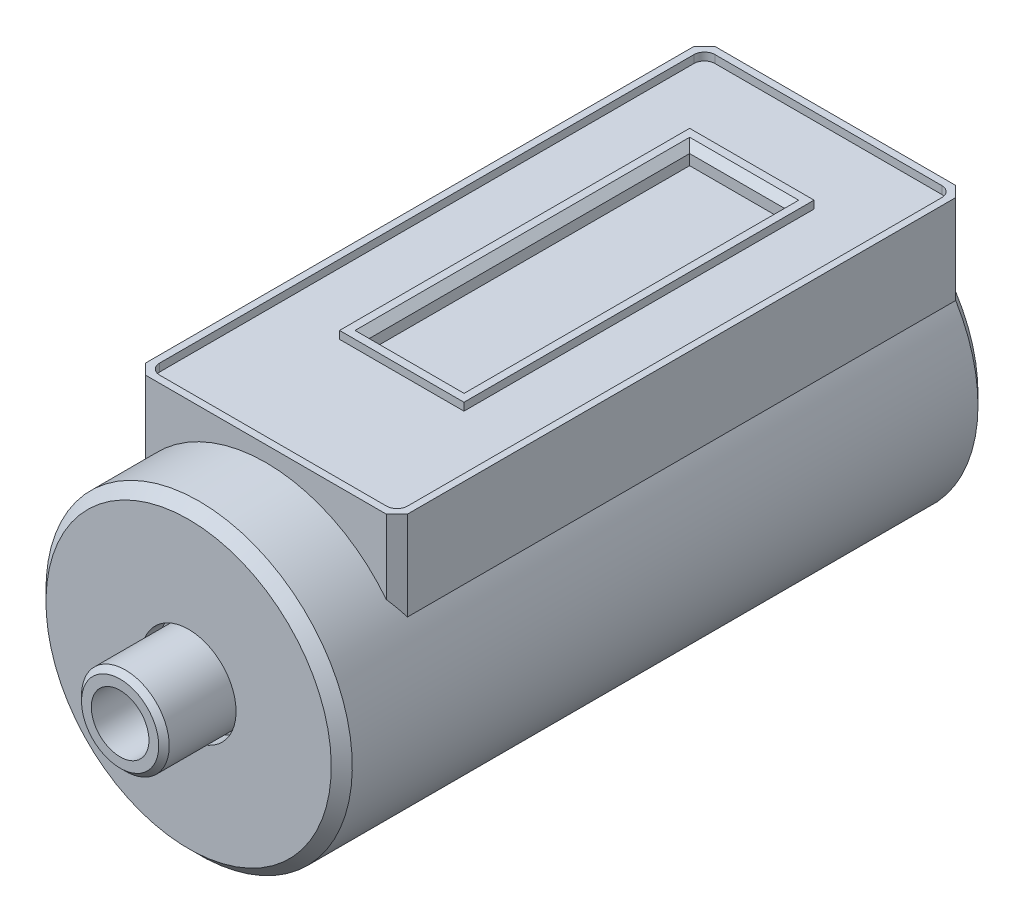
ISO-10303-21;
HEADER;
FILE_DESCRIPTION(('STEP AP214'),'2;1');
FILE_NAME('part.step','',(''),(''),'','','');
FILE_SCHEMA(('AUTOMOTIVE_DESIGN { 1 0 10303 214 1 1 1 1 }'));
ENDSEC;
DATA;
#1=APPLICATION_CONTEXT('core data for automotive mechanical design processes');
#2=APPLICATION_PROTOCOL_DEFINITION('international standard','automotive_design',2000,#1);
#3=PRODUCT_CONTEXT('',#1,'mechanical');
#4=PRODUCT('Part','Part','',(#3));
#5=PRODUCT_RELATED_PRODUCT_CATEGORY('part','',(#4));
#6=PRODUCT_DEFINITION_FORMATION('','',#4);
#7=PRODUCT_DEFINITION_CONTEXT('part definition',#1,'design');
#8=PRODUCT_DEFINITION('design','',#6,#7);
#9=PRODUCT_DEFINITION_SHAPE('','',#8);
#10=(LENGTH_UNIT() NAMED_UNIT(*) SI_UNIT(.MILLI.,.METRE.));
#11=(NAMED_UNIT(*) PLANE_ANGLE_UNIT() SI_UNIT($,.RADIAN.));
#12=(NAMED_UNIT(*) SI_UNIT($,.STERADIAN.) SOLID_ANGLE_UNIT());
#13=UNCERTAINTY_MEASURE_WITH_UNIT(LENGTH_MEASURE(1.E-05),#10,'distance_accuracy_value','');
#14=(GEOMETRIC_REPRESENTATION_CONTEXT(3) GLOBAL_UNCERTAINTY_ASSIGNED_CONTEXT((#13)) GLOBAL_UNIT_ASSIGNED_CONTEXT((#10,
#11,#12)) REPRESENTATION_CONTEXT('',''));
#15=CARTESIAN_POINT('',(0.,0.,0.));
#16=DIRECTION('',(0.,0.,1.));
#17=DIRECTION('',(1.,0.,0.));
#18=AXIS2_PLACEMENT_3D('',#15,#16,#17);
#19=CARTESIAN_POINT('',(0.,0.,-98.425));
#20=DIRECTION('',(0.,0.,-1.));
#21=DIRECTION('',(0.,1.,0.));
#22=AXIS2_PLACEMENT_3D('',#19,#20,#21);
#23=CYLINDRICAL_SURFACE('',#22,11.07);
#24=CARTESIAN_POINT('',(0.,0.,-52.445));
#25=DIRECTION('',(0.,0.,-1.));
#26=DIRECTION('',(0.,1.,0.));
#27=AXIS2_PLACEMENT_3D('',#24,#25,#26);
#28=CIRCLE('',#27,11.07);
#29=CARTESIAN_POINT('',(0.,11.07,-52.445));
#30=VERTEX_POINT('',#29);
#31=EDGE_CURVE('E377',#30,#30,#28,.T.);
#32=ORIENTED_EDGE('',*,*,#31,.T.);
#33=EDGE_LOOP('',(#32));
#34=FACE_BOUND('',#33,.T.);
#35=DIRECTION('',(0.,0.,-1.));
#36=VECTOR('',#35,1.);
#37=CARTESIAN_POINT('',(-9.46,5.74919994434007,-98.425));
#38=LINE('',#37,#36);
#39=CARTESIAN_POINT('',(-9.46,5.74919994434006,-58.035));
#40=VERTEX_POINT('',#39);
#41=CARTESIAN_POINT('',(-9.46,5.74919994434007,-97.665));
#42=VERTEX_POINT('',#41);
#43=EDGE_CURVE('E374',#40,#42,#38,.T.);
#44=ORIENTED_EDGE('',*,*,#43,.T.);
#45=CARTESIAN_POINT('',(0.,0.,-97.665));
#46=DIRECTION('',(0.,0.,-1.));
#47=DIRECTION('',(0.,1.,0.));
#48=AXIS2_PLACEMENT_3D('',#45,#46,#47);
#49=CIRCLE('',#48,11.07);
#50=CARTESIAN_POINT('',(9.45999999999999,5.74919994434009,-97.665));
#51=VERTEX_POINT('',#50);
#52=EDGE_CURVE('E420',#42,#51,#49,.F.);
#53=ORIENTED_EDGE('',*,*,#52,.T.);
#54=DIRECTION('',(0.,0.,-1.));
#55=VECTOR('',#54,1.);
#56=CARTESIAN_POINT('',(9.45999999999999,5.74919994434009,-98.425));
#57=LINE('',#56,#55);
#58=CARTESIAN_POINT('',(9.46,5.74919994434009,-58.035));
#59=VERTEX_POINT('',#58);
#60=EDGE_CURVE('E372',#51,#59,#57,.F.);
#61=ORIENTED_EDGE('',*,*,#60,.T.);
#62=CARTESIAN_POINT('',(0.,0.,-48.5749999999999));
#63=DIRECTION('',(-0.707106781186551,0.,-0.707106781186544));
#64=DIRECTION('',(0.707106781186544,0.,-0.707106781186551));
#65=AXIS2_PLACEMENT_3D('',#62,#63,#64);
#66=ELLIPSE('',#65,15.6553441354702,11.07);
#67=CARTESIAN_POINT('',(8.70000000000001,6.84506391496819,-57.275));
#68=VERTEX_POINT('',#67);
#69=EDGE_CURVE('E398',#59,#68,#66,.F.);
#70=ORIENTED_EDGE('',*,*,#69,.T.);
#71=CARTESIAN_POINT('',(0.,0.,-57.275));
#72=DIRECTION('',(0.,0.,-1.));
#73=DIRECTION('',(-1.,0.,0.));
#74=AXIS2_PLACEMENT_3D('',#71,#72,#73);
#75=CIRCLE('',#74,11.07);
#76=CARTESIAN_POINT('',(-8.7,6.8450639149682,-57.275));
#77=VERTEX_POINT('',#76);
#78=EDGE_CURVE('E401',#68,#77,#75,.F.);
#79=ORIENTED_EDGE('',*,*,#78,.T.);
#80=CARTESIAN_POINT('',(0.,0.,-48.575));
#81=DIRECTION('',(0.707106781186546,0.,-0.707106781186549));
#82=DIRECTION('',(-0.707106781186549,0.,-0.707106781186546));
#83=AXIS2_PLACEMENT_3D('',#80,#81,#82);
#84=ELLIPSE('',#83,15.6553441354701,11.07);
#85=EDGE_CURVE('E404',#77,#40,#84,.F.);
#86=ORIENTED_EDGE('',*,*,#85,.T.);
#87=EDGE_LOOP('',(#44,#53,#61,#70,#79,#86));
#88=FACE_BOUND('',#87,.T.);
#89=ADVANCED_FACE('F33',(#34,#88),#23,.T.);
#90=CARTESIAN_POINT('',(0.,0.,-46.735));
#91=DIRECTION('',(0.,0.,1.));
#92=DIRECTION('',(0.,-1.,0.));
#93=AXIS2_PLACEMENT_3D('',#90,#91,#92);
#94=PLANE('',#93);
#95=CARTESIAN_POINT('',(0.,0.,-46.735));
#96=DIRECTION('',(0.,0.,1.));
#97=DIRECTION('',(1.,0.,0.));
#98=AXIS2_PLACEMENT_3D('',#95,#96,#97);
#99=CIRCLE('',#98,2.0828);
#100=CARTESIAN_POINT('',(2.0828,0.,-46.735));
#101=VERTEX_POINT('',#100);
#102=EDGE_CURVE('E219',#101,#101,#99,.T.);
#103=ORIENTED_EDGE('',*,*,#102,.F.);
#104=EDGE_LOOP('',(#103));
#105=FACE_BOUND('',#104,.T.);
#106=CARTESIAN_POINT('',(0.,0.,-46.735));
#107=DIRECTION('',(0.,0.,-1.));
#108=DIRECTION('',(0.,1.,0.));
#109=AXIS2_PLACEMENT_3D('',#106,#107,#108);
#110=CIRCLE('',#109,2.79);
#111=CARTESIAN_POINT('',(0.,2.79,-46.735));
#112=VERTEX_POINT('',#111);
#113=EDGE_CURVE('E395',#112,#112,#110,.T.);
#114=ORIENTED_EDGE('',*,*,#113,.F.);
#115=EDGE_LOOP('',(#114));
#116=FACE_BOUND('',#115,.T.);
#117=ADVANCED_FACE('F466',(#105,#116),#94,.T.);
#118=CARTESIAN_POINT('',(0.,0.,-47.115));
#119=DIRECTION('',(0.,0.,-1.));
#120=DIRECTION('',(0.,1.,0.));
#121=AXIS2_PLACEMENT_3D('',#118,#119,#120);
#122=CONICAL_SURFACE('',#121,3.17,0.785398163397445);
#123=ORIENTED_EDGE('',*,*,#113,.T.);
#124=EDGE_LOOP('',(#123));
#125=FACE_BOUND('',#124,.T.);
#126=CARTESIAN_POINT('',(0.,0.,-47.115));
#127=DIRECTION('',(0.,0.,-1.));
#128=DIRECTION('',(0.,1.,0.));
#129=AXIS2_PLACEMENT_3D('',#126,#127,#128);
#130=CIRCLE('',#129,3.17);
#131=CARTESIAN_POINT('',(0.,3.16999999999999,-47.115));
#132=VERTEX_POINT('',#131);
#133=EDGE_CURVE('E392',#132,#132,#130,.T.);
#134=ORIENTED_EDGE('',*,*,#133,.F.);
#135=EDGE_LOOP('',(#134));
#136=FACE_BOUND('',#135,.T.);
#137=ADVANCED_FACE('F472',(#125,#136),#122,.T.);
#138=CARTESIAN_POINT('',(0.,0.,-98.425));
#139=DIRECTION('',(0.,0.,-1.));
#140=DIRECTION('',(0.,1.,0.));
#141=AXIS2_PLACEMENT_3D('',#138,#139,#140);
#142=CYLINDRICAL_SURFACE('',#141,3.17);
#143=ORIENTED_EDGE('',*,*,#133,.T.);
#144=EDGE_LOOP('',(#143));
#145=FACE_BOUND('',#144,.T.);
#146=CARTESIAN_POINT('',(0.,0.,-52.955));
#147=DIRECTION('',(0.,0.,-1.));
#148=DIRECTION('',(0.,1.,0.));
#149=AXIS2_PLACEMENT_3D('',#146,#147,#148);
#150=CIRCLE('',#149,3.17);
#151=CARTESIAN_POINT('',(0.,3.16999999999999,-52.955));
#152=VERTEX_POINT('',#151);
#153=EDGE_CURVE('E389',#152,#152,#150,.T.);
#154=ORIENTED_EDGE('',*,*,#153,.F.);
#155=EDGE_LOOP('',(#154));
#156=FACE_BOUND('',#155,.T.);
#157=ADVANCED_FACE('F494',(#145,#156),#142,.T.);
#158=CARTESIAN_POINT('',(0.,3.42999999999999,-52.955));
#159=DIRECTION('',(0.,0.,1.));
#160=DIRECTION('',(0.,-1.,0.));
#161=AXIS2_PLACEMENT_3D('',#158,#159,#160);
#162=PLANE('',#161);
#163=ORIENTED_EDGE('',*,*,#153,.T.);
#164=EDGE_LOOP('',(#163));
#165=FACE_BOUND('',#164,.T.);
#166=CARTESIAN_POINT('',(0.,0.,-52.955));
#167=DIRECTION('',(0.,0.,-1.));
#168=DIRECTION('',(0.,1.,0.));
#169=AXIS2_PLACEMENT_3D('',#166,#167,#168);
#170=CIRCLE('',#169,3.43);
#171=CARTESIAN_POINT('',(0.,3.42999999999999,-52.955));
#172=VERTEX_POINT('',#171);
#173=EDGE_CURVE('E386',#172,#172,#170,.T.);
#174=ORIENTED_EDGE('',*,*,#173,.F.);
#175=EDGE_LOOP('',(#174));
#176=FACE_BOUND('',#175,.T.);
#177=ADVANCED_FACE('F490',(#165,#176),#162,.T.);
#178=CARTESIAN_POINT('',(0.,0.,-98.425));
#179=DIRECTION('',(0.,0.,-1.));
#180=DIRECTION('',(0.,1.,0.));
#181=AXIS2_PLACEMENT_3D('',#178,#179,#180);
#182=CYLINDRICAL_SURFACE('',#181,3.43);
#183=ORIENTED_EDGE('',*,*,#173,.T.);
#184=EDGE_LOOP('',(#183));
#185=FACE_BOUND('',#184,.T.);
#186=CARTESIAN_POINT('',(0.,0.,-51.685));
#187=DIRECTION('',(0.,0.,-1.));
#188=DIRECTION('',(0.,1.,0.));
#189=AXIS2_PLACEMENT_3D('',#186,#187,#188);
#190=CIRCLE('',#189,3.43);
#191=CARTESIAN_POINT('',(0.,3.42999999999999,-51.685));
#192=VERTEX_POINT('',#191);
#193=EDGE_CURVE('E383',#192,#192,#190,.T.);
#194=ORIENTED_EDGE('',*,*,#193,.F.);
#195=EDGE_LOOP('',(#194));
#196=FACE_BOUND('',#195,.T.);
#197=ADVANCED_FACE('F486',(#185,#196),#182,.F.);
#198=CARTESIAN_POINT('',(0.,3.42999999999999,-51.685));
#199=DIRECTION('',(0.,0.,1.));
#200=DIRECTION('',(0.,-1.,0.));
#201=AXIS2_PLACEMENT_3D('',#198,#199,#200);
#202=PLANE('',#201);
#203=ORIENTED_EDGE('',*,*,#193,.T.);
#204=EDGE_LOOP('',(#203));
#205=FACE_BOUND('',#204,.T.);
#206=CARTESIAN_POINT('',(0.,0.,-51.685));
#207=DIRECTION('',(0.,0.,-1.));
#208=DIRECTION('',(0.,1.,0.));
#209=AXIS2_PLACEMENT_3D('',#206,#207,#208);
#210=CIRCLE('',#209,10.31);
#211=CARTESIAN_POINT('',(0.,10.31,-51.685));
#212=VERTEX_POINT('',#211);
#213=EDGE_CURVE('E380',#212,#212,#210,.T.);
#214=ORIENTED_EDGE('',*,*,#213,.F.);
#215=EDGE_LOOP('',(#214));
#216=FACE_BOUND('',#215,.T.);
#217=ADVANCED_FACE('F482',(#205,#216),#202,.T.);
#218=CARTESIAN_POINT('',(0.,0.,-52.445));
#219=DIRECTION('',(0.,0.,-1.));
#220=DIRECTION('',(0.,1.,0.));
#221=AXIS2_PLACEMENT_3D('',#218,#219,#220);
#222=CONICAL_SURFACE('',#221,11.07,0.785398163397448);
#223=ORIENTED_EDGE('',*,*,#213,.T.);
#224=EDGE_LOOP('',(#223));
#225=FACE_BOUND('',#224,.T.);
#226=ORIENTED_EDGE('',*,*,#31,.F.);
#227=EDGE_LOOP('',(#226));
#228=FACE_BOUND('',#227,.T.);
#229=ADVANCED_FACE('F479',(#225,#228),#222,.T.);
#230=CARTESIAN_POINT('',(0.,11.07,-98.425));
#231=DIRECTION('',(0.,0.,-1.));
#232=DIRECTION('',(0.,1.,0.));
#233=AXIS2_PLACEMENT_3D('',#230,#231,#232);
#234=PLANE('',#233);
#235=CARTESIAN_POINT('',(0.,0.,-98.425));
#236=DIRECTION('',(0.,0.,-1.));
#237=DIRECTION('',(0.,1.,0.));
#238=AXIS2_PLACEMENT_3D('',#235,#236,#237);
#239=CIRCLE('',#238,10.31);
#240=CARTESIAN_POINT('',(8.69999999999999,5.532278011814,-98.425));
#241=VERTEX_POINT('',#240);
#242=CARTESIAN_POINT('',(-8.69999999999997,5.53227801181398,-98.425));
#243=VERTEX_POINT('',#242);
#244=EDGE_CURVE('E412',#241,#243,#239,.T.);
#245=ORIENTED_EDGE('',*,*,#244,.T.);
#246=DIRECTION('',(0.,1.,0.));
#247=VECTOR('',#246,1.);
#248=CARTESIAN_POINT('',(-8.70000000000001,12.19,-98.425));
#249=LINE('',#248,#247);
#250=CARTESIAN_POINT('',(-8.70000000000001,12.19,-98.425));
#251=VERTEX_POINT('',#250);
#252=EDGE_CURVE('E414',#243,#251,#249,.T.);
#253=ORIENTED_EDGE('',*,*,#252,.T.);
#254=DIRECTION('',(-1.,0.,0.));
#255=VECTOR('',#254,1.);
#256=CARTESIAN_POINT('',(-9.46,12.19,-98.425));
#257=LINE('',#256,#255);
#258=CARTESIAN_POINT('',(8.69999999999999,12.19,-98.425));
#259=VERTEX_POINT('',#258);
#260=EDGE_CURVE('E357',#259,#251,#257,.T.);
#261=ORIENTED_EDGE('',*,*,#260,.F.);
#262=DIRECTION('',(0.,-1.,0.));
#263=VECTOR('',#262,1.);
#264=CARTESIAN_POINT('',(8.69999999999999,5.74919994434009,-98.425));
#265=LINE('',#264,#263);
#266=EDGE_CURVE('E410',#259,#241,#265,.T.);
#267=ORIENTED_EDGE('',*,*,#266,.T.);
#268=EDGE_LOOP('',(#245,#253,#261,#267));
#269=FACE_BOUND('',#268,.T.);
#270=ADVANCED_FACE('F477',(#269),#234,.T.);
#271=CARTESIAN_POINT('',(-9.46,12.19,-98.425));
#272=DIRECTION('',(1.,0.,0.));
#273=DIRECTION('',(0.,0.,-1.));
#274=AXIS2_PLACEMENT_3D('',#271,#272,#273);
#275=PLANE('',#274);
#276=DIRECTION('',(0.,0.,1.));
#277=VECTOR('',#276,1.);
#278=CARTESIAN_POINT('',(-9.46,12.19,-98.425));
#279=LINE('',#278,#277);
#280=CARTESIAN_POINT('',(-9.46,12.19,-97.665));
#281=VERTEX_POINT('',#280);
#282=CARTESIAN_POINT('',(-9.46,12.19,-58.035));
#283=VERTEX_POINT('',#282);
#284=EDGE_CURVE('E345',#281,#283,#279,.T.);
#285=ORIENTED_EDGE('',*,*,#284,.F.);
#286=DIRECTION('',(0.,-1.,0.));
#287=VECTOR('',#286,1.);
#288=CARTESIAN_POINT('',(-9.46,5.74919994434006,-97.665));
#289=LINE('',#288,#287);
#290=EDGE_CURVE('E407',#281,#42,#289,.T.);
#291=ORIENTED_EDGE('',*,*,#290,.T.);
#292=ORIENTED_EDGE('',*,*,#43,.F.);
#293=DIRECTION('',(0.,-1.,0.));
#294=VECTOR('',#293,1.);
#295=CARTESIAN_POINT('',(-9.46,12.19,-58.035));
#296=LINE('',#295,#294);
#297=EDGE_CURVE('E369',#283,#40,#296,.T.);
#298=ORIENTED_EDGE('',*,*,#297,.F.);
#299=EDGE_LOOP('',(#285,#291,#292,#298));
#300=FACE_BOUND('',#299,.T.);
#301=ADVANCED_FACE('F546',(#300),#275,.F.);
#302=CARTESIAN_POINT('',(-9.46,12.19,-58.035));
#303=DIRECTION('',(0.707106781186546,0.,-0.707106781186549));
#304=DIRECTION('',(-0.707106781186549,0.,-0.707106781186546));
#305=AXIS2_PLACEMENT_3D('',#302,#303,#304);
#306=PLANE('',#305);
#307=ORIENTED_EDGE('',*,*,#85,.F.);
#308=DIRECTION('',(0.,-1.,0.));
#309=VECTOR('',#308,1.);
#310=CARTESIAN_POINT('',(-8.7,12.19,-57.275));
#311=LINE('',#310,#309);
#312=CARTESIAN_POINT('',(-8.7,12.19,-57.275));
#313=VERTEX_POINT('',#312);
#314=EDGE_CURVE('E366',#313,#77,#311,.T.);
#315=ORIENTED_EDGE('',*,*,#314,.F.);
#316=DIRECTION('',(0.707106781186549,0.,0.707106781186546));
#317=VECTOR('',#316,1.);
#318=CARTESIAN_POINT('',(-9.46,12.19,-58.035));
#319=LINE('',#318,#317);
#320=EDGE_CURVE('E347',#283,#313,#319,.T.);
#321=ORIENTED_EDGE('',*,*,#320,.F.);
#322=ORIENTED_EDGE('',*,*,#297,.T.);
#323=EDGE_LOOP('',(#307,#315,#321,#322));
#324=FACE_BOUND('',#323,.T.);
#325=ADVANCED_FACE('F553',(#324),#306,.F.);
#326=CARTESIAN_POINT('',(-8.7,12.19,-57.275));
#327=DIRECTION('',(0.,0.,-1.));
#328=DIRECTION('',(-1.,0.,0.));
#329=AXIS2_PLACEMENT_3D('',#326,#327,#328);
#330=PLANE('',#329);
#331=ORIENTED_EDGE('',*,*,#78,.F.);
#332=DIRECTION('',(0.,-1.,0.));
#333=VECTOR('',#332,1.);
#334=CARTESIAN_POINT('',(8.70000000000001,12.19,-57.275));
#335=LINE('',#334,#333);
#336=CARTESIAN_POINT('',(8.70000000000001,12.19,-57.275));
#337=VERTEX_POINT('',#336);
#338=EDGE_CURVE('E363',#337,#68,#335,.T.);
#339=ORIENTED_EDGE('',*,*,#338,.F.);
#340=DIRECTION('',(1.,0.,0.));
#341=VECTOR('',#340,1.);
#342=CARTESIAN_POINT('',(-8.7,12.19,-57.275));
#343=LINE('',#342,#341);
#344=EDGE_CURVE('E350',#313,#337,#343,.T.);
#345=ORIENTED_EDGE('',*,*,#344,.F.);
#346=ORIENTED_EDGE('',*,*,#314,.T.);
#347=EDGE_LOOP('',(#331,#339,#345,#346));
#348=FACE_BOUND('',#347,.T.);
#349=ADVANCED_FACE('F560',(#348),#330,.F.);
#350=CARTESIAN_POINT('',(9.46,12.19,-58.035));
#351=DIRECTION('',(-0.707106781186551,0.,-0.707106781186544));
#352=DIRECTION('',(-0.707106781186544,0.,0.707106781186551));
#353=AXIS2_PLACEMENT_3D('',#350,#351,#352);
#354=PLANE('',#353);
#355=ORIENTED_EDGE('',*,*,#69,.F.);
#356=DIRECTION('',(0.,-1.,0.));
#357=VECTOR('',#356,1.);
#358=CARTESIAN_POINT('',(9.46,12.19,-58.035));
#359=LINE('',#358,#357);
#360=CARTESIAN_POINT('',(9.46,12.19,-58.035));
#361=VERTEX_POINT('',#360);
#362=EDGE_CURVE('E360',#361,#59,#359,.T.);
#363=ORIENTED_EDGE('',*,*,#362,.F.);
#364=DIRECTION('',(0.707106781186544,0.,-0.707106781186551));
#365=VECTOR('',#364,1.);
#366=CARTESIAN_POINT('',(9.46,12.19,-58.035));
#367=LINE('',#366,#365);
#368=EDGE_CURVE('E352',#337,#361,#367,.T.);
#369=ORIENTED_EDGE('',*,*,#368,.F.);
#370=ORIENTED_EDGE('',*,*,#338,.T.);
#371=EDGE_LOOP('',(#355,#363,#369,#370));
#372=FACE_BOUND('',#371,.T.);
#373=ADVANCED_FACE('F568',(#372),#354,.F.);
#374=CARTESIAN_POINT('',(9.45999999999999,12.19,-98.425));
#375=DIRECTION('',(-1.,0.,0.));
#376=DIRECTION('',(0.,0.,1.));
#377=AXIS2_PLACEMENT_3D('',#374,#375,#376);
#378=PLANE('',#377);
#379=ORIENTED_EDGE('',*,*,#60,.F.);
#380=DIRECTION('',(0.,1.,0.));
#381=VECTOR('',#380,1.);
#382=CARTESIAN_POINT('',(9.45999999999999,12.19,-97.665));
#383=LINE('',#382,#381);
#384=CARTESIAN_POINT('',(9.45999999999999,12.19,-97.665));
#385=VERTEX_POINT('',#384);
#386=EDGE_CURVE('E422',#51,#385,#383,.T.);
#387=ORIENTED_EDGE('',*,*,#386,.T.);
#388=DIRECTION('',(0.,0.,-1.));
#389=VECTOR('',#388,1.);
#390=CARTESIAN_POINT('',(9.45999999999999,12.19,-98.425));
#391=LINE('',#390,#389);
#392=EDGE_CURVE('E354',#361,#385,#391,.T.);
#393=ORIENTED_EDGE('',*,*,#392,.F.);
#394=ORIENTED_EDGE('',*,*,#362,.T.);
#395=EDGE_LOOP('',(#379,#387,#393,#394));
#396=FACE_BOUND('',#395,.T.);
#397=ADVANCED_FACE('F576',(#396),#378,.F.);
#398=CARTESIAN_POINT('',(-9.46,12.19,-98.425));
#399=DIRECTION('',(0.,1.,0.));
#400=DIRECTION('',(0.,0.,1.));
#401=AXIS2_PLACEMENT_3D('',#398,#399,#400);
#402=PLANE('',#401);
#403=CARTESIAN_POINT('',(-8.19,12.19,-97.155));
#404=DIRECTION('',(0.,1.,0.));
#405=DIRECTION('',(0.,0.,-1.));
#406=AXIS2_PLACEMENT_3D('',#403,#404,#405);
#407=CIRCLE('',#406,0.760000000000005);
#408=CARTESIAN_POINT('',(-8.19,12.19,-97.915));
#409=VERTEX_POINT('',#408);
#410=CARTESIAN_POINT('',(-8.95,12.19,-97.155));
#411=VERTEX_POINT('',#410);
#412=EDGE_CURVE('E274',#409,#411,#407,.T.);
#413=ORIENTED_EDGE('',*,*,#412,.F.);
#414=DIRECTION('',(-1.,0.,0.));
#415=VECTOR('',#414,1.);
#416=CARTESIAN_POINT('',(-8.19,12.19,-97.915));
#417=LINE('',#416,#415);
#418=CARTESIAN_POINT('',(8.19999999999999,12.19,-97.915));
#419=VERTEX_POINT('',#418);
#420=EDGE_CURVE('E285',#419,#409,#417,.T.);
#421=ORIENTED_EDGE('',*,*,#420,.F.);
#422=CARTESIAN_POINT('',(8.19999999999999,12.19,-97.155));
#423=DIRECTION('',(0.,1.,0.));
#424=DIRECTION('',(0.,0.,1.));
#425=AXIS2_PLACEMENT_3D('',#422,#423,#424);
#426=CIRCLE('',#425,0.760000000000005);
#427=CARTESIAN_POINT('',(8.95999999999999,12.19,-97.155));
#428=VERTEX_POINT('',#427);
#429=EDGE_CURVE('E323',#428,#419,#426,.T.);
#430=ORIENTED_EDGE('',*,*,#429,.F.);
#431=DIRECTION('',(0.,0.,-1.));
#432=VECTOR('',#431,1.);
#433=CARTESIAN_POINT('',(8.95999999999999,12.19,-97.155));
#434=LINE('',#433,#432);
#435=CARTESIAN_POINT('',(8.96,12.19,-58.545));
#436=VERTEX_POINT('',#435);
#437=EDGE_CURVE('E320',#436,#428,#434,.T.);
#438=ORIENTED_EDGE('',*,*,#437,.F.);
#439=CARTESIAN_POINT('',(8.2,12.19,-58.545));
#440=DIRECTION('',(0.,1.,0.));
#441=DIRECTION('',(0.,0.,-1.));
#442=AXIS2_PLACEMENT_3D('',#439,#440,#441);
#443=CIRCLE('',#442,0.759999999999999);
#444=CARTESIAN_POINT('',(8.2,12.19,-57.785));
#445=VERTEX_POINT('',#444);
#446=EDGE_CURVE('E317',#445,#436,#443,.T.);
#447=ORIENTED_EDGE('',*,*,#446,.F.);
#448=DIRECTION('',(1.,0.,0.));
#449=VECTOR('',#448,1.);
#450=CARTESIAN_POINT('',(-8.19,12.19,-57.785));
#451=LINE('',#450,#449);
#452=CARTESIAN_POINT('',(-8.19,12.19,-57.785));
#453=VERTEX_POINT('',#452);
#454=EDGE_CURVE('E314',#453,#445,#451,.T.);
#455=ORIENTED_EDGE('',*,*,#454,.F.);
#456=CARTESIAN_POINT('',(-8.19,12.19,-58.545));
#457=DIRECTION('',(0.,1.,0.));
#458=DIRECTION('',(0.,0.,1.));
#459=AXIS2_PLACEMENT_3D('',#456,#457,#458);
#460=CIRCLE('',#459,0.759999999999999);
#461=CARTESIAN_POINT('',(-8.95,12.19,-58.545));
#462=VERTEX_POINT('',#461);
#463=EDGE_CURVE('E311',#462,#453,#460,.T.);
#464=ORIENTED_EDGE('',*,*,#463,.F.);
#465=DIRECTION('',(0.,0.,1.));
#466=VECTOR('',#465,1.);
#467=CARTESIAN_POINT('',(-8.95,12.19,-97.155));
#468=LINE('',#467,#466);
#469=EDGE_CURVE('E308',#411,#462,#468,.T.);
#470=ORIENTED_EDGE('',*,*,#469,.F.);
#471=EDGE_LOOP('',(#413,#421,#430,#438,#447,#455,#464,#470));
#472=FACE_BOUND('',#471,.T.);
#473=ORIENTED_EDGE('',*,*,#260,.T.);
#474=DIRECTION('',(-0.707106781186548,0.,0.707106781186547));
#475=VECTOR('',#474,1.);
#476=CARTESIAN_POINT('',(-9.08000000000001,12.19,-98.045));
#477=LINE('',#476,#475);
#478=EDGE_CURVE('E418',#251,#281,#477,.T.);
#479=ORIENTED_EDGE('',*,*,#478,.T.);
#480=ORIENTED_EDGE('',*,*,#284,.T.);
#481=ORIENTED_EDGE('',*,*,#320,.T.);
#482=ORIENTED_EDGE('',*,*,#344,.T.);
#483=ORIENTED_EDGE('',*,*,#368,.T.);
#484=ORIENTED_EDGE('',*,*,#392,.T.);
#485=DIRECTION('',(-0.707106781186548,0.,-0.707106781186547));
#486=VECTOR('',#485,1.);
#487=CARTESIAN_POINT('',(-0.380000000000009,12.19,-107.505));
#488=LINE('',#487,#486);
#489=EDGE_CURVE('E416',#385,#259,#488,.T.);
#490=ORIENTED_EDGE('',*,*,#489,.T.);
#491=EDGE_LOOP('',(#473,#479,#480,#481,#482,#483,#484,#490));
#492=FACE_BOUND('',#491,.T.);
#493=ADVANCED_FACE('F448',(#472,#492),#402,.T.);
#494=CARTESIAN_POINT('',(8.69999999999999,11.07,-98.425));
#495=DIRECTION('',(0.707106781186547,0.,-0.707106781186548));
#496=DIRECTION('',(-0.707106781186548,0.,-0.707106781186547));
#497=AXIS2_PLACEMENT_3D('',#494,#495,#496);
#498=PLANE('',#497);
#499=ORIENTED_EDGE('',*,*,#489,.F.);
#500=ORIENTED_EDGE('',*,*,#386,.F.);
#501=CARTESIAN_POINT('',(9.45999999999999,5.74919994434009,-97.665));
#502=CARTESIAN_POINT('',(9.33323803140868,5.71371419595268,-97.7917619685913));
#503=CARTESIAN_POINT('',(9.20652372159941,5.67789449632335,-97.9184762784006));
#504=CARTESIAN_POINT('',(8.95319038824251,5.60558718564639,-98.1718096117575));
#505=CARTESIAN_POINT('',(8.82657136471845,5.5690995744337,-98.2984286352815));
#506=CARTESIAN_POINT('',(8.69999999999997,5.53227801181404,-98.425));
#507=B_SPLINE_CURVE_WITH_KNOTS('',3,(#501,#502,#503,#504,#505,#506),.UNSPECIFIED.,.F.,.F.,(4,2,
4),(0.,0.548237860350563,1.09647585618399),.UNSPECIFIED.);
#508=EDGE_CURVE('E348',#241,#51,#507,.F.);
#509=ORIENTED_EDGE('',*,*,#508,.F.);
#510=ORIENTED_EDGE('',*,*,#266,.F.);
#511=EDGE_LOOP('',(#499,#500,#509,#510));
#512=FACE_BOUND('',#511,.T.);
#513=ADVANCED_FACE('F442',(#512),#498,.T.);
#514=CARTESIAN_POINT('',(0.,0.,-98.425));
#515=DIRECTION('',(0.,0.,1.));
#516=DIRECTION('',(0.,-1.,0.));
#517=AXIS2_PLACEMENT_3D('',#514,#515,#516);
#518=CONICAL_SURFACE('',#517,10.31,0.785398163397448);
#519=ORIENTED_EDGE('',*,*,#508,.T.);
#520=ORIENTED_EDGE('',*,*,#52,.F.);
#521=CARTESIAN_POINT('',(-9.46,5.74919994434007,-97.665));
#522=CARTESIAN_POINT('',(-9.33323803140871,5.71371419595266,-97.7917619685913));
#523=CARTESIAN_POINT('',(-9.20652372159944,5.67789449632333,-97.9184762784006));
#524=CARTESIAN_POINT('',(-8.95319038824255,5.60558718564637,-98.1718096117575));
#525=CARTESIAN_POINT('',(-8.82657136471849,5.56909957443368,-98.2984286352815));
#526=CARTESIAN_POINT('',(-8.70000000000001,5.53227801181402,-98.425));
#527=B_SPLINE_CURVE_WITH_KNOTS('',3,(#521,#522,#523,#524,#525,#526),.UNSPECIFIED.,.F.,.F.,(4,2,
4),(0.,0.548237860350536,1.09647585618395),.UNSPECIFIED.);
#528=EDGE_CURVE('E330',#243,#42,#527,.F.);
#529=ORIENTED_EDGE('',*,*,#528,.F.);
#530=ORIENTED_EDGE('',*,*,#244,.F.);
#531=EDGE_LOOP('',(#519,#520,#529,#530));
#532=FACE_BOUND('',#531,.T.);
#533=ADVANCED_FACE('F439',(#532),#518,.T.);
#534=CARTESIAN_POINT('',(-9.46,12.19,-97.665));
#535=DIRECTION('',(-0.707106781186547,0.,-0.707106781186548));
#536=DIRECTION('',(-0.707106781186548,0.,0.707106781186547));
#537=AXIS2_PLACEMENT_3D('',#534,#535,#536);
#538=PLANE('',#537);
#539=ORIENTED_EDGE('',*,*,#478,.F.);
#540=ORIENTED_EDGE('',*,*,#252,.F.);
#541=ORIENTED_EDGE('',*,*,#528,.T.);
#542=ORIENTED_EDGE('',*,*,#290,.F.);
#543=EDGE_LOOP('',(#539,#540,#541,#542));
#544=FACE_BOUND('',#543,.T.);
#545=ADVANCED_FACE('F436',(#544),#538,.T.);
#546=CARTESIAN_POINT('',(-8.19,11.63,-97.155));
#547=DIRECTION('',(0.,1.,0.));
#548=DIRECTION('',(0.,0.,1.));
#549=AXIS2_PLACEMENT_3D('',#546,#547,#548);
#550=CYLINDRICAL_SURFACE('',#549,0.760000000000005);
#551=ORIENTED_EDGE('',*,*,#412,.T.);
#552=DIRECTION('',(0.,1.,0.));
#553=VECTOR('',#552,1.);
#554=CARTESIAN_POINT('',(-8.95,11.63,-97.155));
#555=LINE('',#554,#553);
#556=CARTESIAN_POINT('',(-8.95,11.63,-97.155));
#557=VERTEX_POINT('',#556);
#558=EDGE_CURVE('E306',#557,#411,#555,.T.);
#559=ORIENTED_EDGE('',*,*,#558,.F.);
#560=CARTESIAN_POINT('',(-8.19,11.63,-97.155));
#561=DIRECTION('',(0.,1.,0.));
#562=DIRECTION('',(0.,0.,-1.));
#563=AXIS2_PLACEMENT_3D('',#560,#561,#562);
#564=CIRCLE('',#563,0.760000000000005);
#565=CARTESIAN_POINT('',(-8.19,11.63,-97.915));
#566=VERTEX_POINT('',#565);
#567=EDGE_CURVE('E281',#566,#557,#564,.T.);
#568=ORIENTED_EDGE('',*,*,#567,.F.);
#569=DIRECTION('',(0.,1.,0.));
#570=VECTOR('',#569,1.);
#571=CARTESIAN_POINT('',(-8.19,11.63,-97.915));
#572=LINE('',#571,#570);
#573=EDGE_CURVE('E328',#566,#409,#572,.T.);
#574=ORIENTED_EDGE('',*,*,#573,.T.);
#575=EDGE_LOOP('',(#551,#559,#568,#574));
#576=FACE_BOUND('',#575,.T.);
#577=ADVANCED_FACE('F607',(#576),#550,.F.);
#578=CARTESIAN_POINT('',(-8.19,11.63,-97.915));
#579=DIRECTION('',(0.,0.,-1.));
#580=DIRECTION('',(-1.,0.,0.));
#581=AXIS2_PLACEMENT_3D('',#578,#579,#580);
#582=PLANE('',#581);
#583=ORIENTED_EDGE('',*,*,#420,.T.);
#584=ORIENTED_EDGE('',*,*,#573,.F.);
#585=DIRECTION('',(-1.,0.,0.));
#586=VECTOR('',#585,1.);
#587=CARTESIAN_POINT('',(-8.19,11.63,-97.915));
#588=LINE('',#587,#586);
#589=CARTESIAN_POINT('',(8.19999999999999,11.63,-97.915));
#590=VERTEX_POINT('',#589);
#591=EDGE_CURVE('E303',#590,#566,#588,.T.);
#592=ORIENTED_EDGE('',*,*,#591,.F.);
#593=DIRECTION('',(0.,1.,0.));
#594=VECTOR('',#593,1.);
#595=CARTESIAN_POINT('',(8.19999999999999,11.63,-97.915));
#596=LINE('',#595,#594);
#597=EDGE_CURVE('E331',#590,#419,#596,.T.);
#598=ORIENTED_EDGE('',*,*,#597,.T.);
#599=EDGE_LOOP('',(#583,#584,#592,#598));
#600=FACE_BOUND('',#599,.T.);
#601=ADVANCED_FACE('F613',(#600),#582,.F.);
#602=CARTESIAN_POINT('',(8.19999999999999,11.63,-97.155));
#603=DIRECTION('',(0.,1.,0.));
#604=DIRECTION('',(0.,0.,1.));
#605=AXIS2_PLACEMENT_3D('',#602,#603,#604);
#606=CYLINDRICAL_SURFACE('',#605,0.760000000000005);
#607=ORIENTED_EDGE('',*,*,#429,.T.);
#608=ORIENTED_EDGE('',*,*,#597,.F.);
#609=CARTESIAN_POINT('',(8.19999999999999,11.63,-97.155));
#610=DIRECTION('',(0.,1.,0.));
#611=DIRECTION('',(0.,0.,1.));
#612=AXIS2_PLACEMENT_3D('',#609,#610,#611);
#613=CIRCLE('',#612,0.760000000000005);
#614=CARTESIAN_POINT('',(8.95999999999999,11.63,-97.155));
#615=VERTEX_POINT('',#614);
#616=EDGE_CURVE('E300',#615,#590,#613,.T.);
#617=ORIENTED_EDGE('',*,*,#616,.F.);
#618=DIRECTION('',(0.,1.,0.));
#619=VECTOR('',#618,1.);
#620=CARTESIAN_POINT('',(8.95999999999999,11.63,-97.155));
#621=LINE('',#620,#619);
#622=EDGE_CURVE('E333',#615,#428,#621,.T.);
#623=ORIENTED_EDGE('',*,*,#622,.T.);
#624=EDGE_LOOP('',(#607,#608,#617,#623));
#625=FACE_BOUND('',#624,.T.);
#626=ADVANCED_FACE('F621',(#625),#606,.F.);
#627=CARTESIAN_POINT('',(8.95999999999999,11.63,-97.155));
#628=DIRECTION('',(1.,0.,0.));
#629=DIRECTION('',(0.,0.,-1.));
#630=AXIS2_PLACEMENT_3D('',#627,#628,#629);
#631=PLANE('',#630);
#632=ORIENTED_EDGE('',*,*,#437,.T.);
#633=ORIENTED_EDGE('',*,*,#622,.F.);
#634=DIRECTION('',(0.,0.,-1.));
#635=VECTOR('',#634,1.);
#636=CARTESIAN_POINT('',(8.95999999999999,11.63,-97.155));
#637=LINE('',#636,#635);
#638=CARTESIAN_POINT('',(8.96,11.63,-58.545));
#639=VERTEX_POINT('',#638);
#640=EDGE_CURVE('E297',#639,#615,#637,.T.);
#641=ORIENTED_EDGE('',*,*,#640,.F.);
#642=DIRECTION('',(0.,1.,0.));
#643=VECTOR('',#642,1.);
#644=CARTESIAN_POINT('',(8.96,11.63,-58.545));
#645=LINE('',#644,#643);
#646=EDGE_CURVE('E335',#639,#436,#645,.T.);
#647=ORIENTED_EDGE('',*,*,#646,.T.);
#648=EDGE_LOOP('',(#632,#633,#641,#647));
#649=FACE_BOUND('',#648,.T.);
#650=ADVANCED_FACE('F629',(#649),#631,.F.);
#651=CARTESIAN_POINT('',(8.2,11.63,-58.545));
#652=DIRECTION('',(0.,1.,0.));
#653=DIRECTION('',(0.,0.,1.));
#654=AXIS2_PLACEMENT_3D('',#651,#652,#653);
#655=CYLINDRICAL_SURFACE('',#654,0.759999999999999);
#656=ORIENTED_EDGE('',*,*,#446,.T.);
#657=ORIENTED_EDGE('',*,*,#646,.F.);
#658=CARTESIAN_POINT('',(8.2,11.63,-58.545));
#659=DIRECTION('',(0.,1.,0.));
#660=DIRECTION('',(0.,0.,-1.));
#661=AXIS2_PLACEMENT_3D('',#658,#659,#660);
#662=CIRCLE('',#661,0.759999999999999);
#663=CARTESIAN_POINT('',(8.2,11.63,-57.785));
#664=VERTEX_POINT('',#663);
#665=EDGE_CURVE('E294',#664,#639,#662,.T.);
#666=ORIENTED_EDGE('',*,*,#665,.F.);
#667=DIRECTION('',(0.,1.,0.));
#668=VECTOR('',#667,1.);
#669=CARTESIAN_POINT('',(8.2,11.63,-57.785));
#670=LINE('',#669,#668);
#671=EDGE_CURVE('E337',#664,#445,#670,.T.);
#672=ORIENTED_EDGE('',*,*,#671,.T.);
#673=EDGE_LOOP('',(#656,#657,#666,#672));
#674=FACE_BOUND('',#673,.T.);
#675=ADVANCED_FACE('F637',(#674),#655,.F.);
#676=CARTESIAN_POINT('',(-8.19,11.63,-57.785));
#677=DIRECTION('',(0.,0.,1.));
#678=DIRECTION('',(1.,0.,0.));
#679=AXIS2_PLACEMENT_3D('',#676,#677,#678);
#680=PLANE('',#679);
#681=ORIENTED_EDGE('',*,*,#454,.T.);
#682=ORIENTED_EDGE('',*,*,#671,.F.);
#683=DIRECTION('',(1.,0.,0.));
#684=VECTOR('',#683,1.);
#685=CARTESIAN_POINT('',(-8.19,11.63,-57.785));
#686=LINE('',#685,#684);
#687=CARTESIAN_POINT('',(-8.19,11.63,-57.785));
#688=VERTEX_POINT('',#687);
#689=EDGE_CURVE('E291',#688,#664,#686,.T.);
#690=ORIENTED_EDGE('',*,*,#689,.F.);
#691=DIRECTION('',(0.,1.,0.));
#692=VECTOR('',#691,1.);
#693=CARTESIAN_POINT('',(-8.19,11.63,-57.785));
#694=LINE('',#693,#692);
#695=EDGE_CURVE('E339',#688,#453,#694,.T.);
#696=ORIENTED_EDGE('',*,*,#695,.T.);
#697=EDGE_LOOP('',(#681,#682,#690,#696));
#698=FACE_BOUND('',#697,.T.);
#699=ADVANCED_FACE('F645',(#698),#680,.F.);
#700=CARTESIAN_POINT('',(-8.19,11.63,-58.545));
#701=DIRECTION('',(0.,1.,0.));
#702=DIRECTION('',(0.,0.,1.));
#703=AXIS2_PLACEMENT_3D('',#700,#701,#702);
#704=CYLINDRICAL_SURFACE('',#703,0.759999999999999);
#705=ORIENTED_EDGE('',*,*,#463,.T.);
#706=ORIENTED_EDGE('',*,*,#695,.F.);
#707=CARTESIAN_POINT('',(-8.19,11.63,-58.545));
#708=DIRECTION('',(0.,1.,0.));
#709=DIRECTION('',(0.,0.,1.));
#710=AXIS2_PLACEMENT_3D('',#707,#708,#709);
#711=CIRCLE('',#710,0.759999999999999);
#712=CARTESIAN_POINT('',(-8.95,11.63,-58.545));
#713=VERTEX_POINT('',#712);
#714=EDGE_CURVE('E288',#713,#688,#711,.T.);
#715=ORIENTED_EDGE('',*,*,#714,.F.);
#716=DIRECTION('',(0.,1.,0.));
#717=VECTOR('',#716,1.);
#718=CARTESIAN_POINT('',(-8.95,11.63,-58.545));
#719=LINE('',#718,#717);
#720=EDGE_CURVE('E341',#713,#462,#719,.T.);
#721=ORIENTED_EDGE('',*,*,#720,.T.);
#722=EDGE_LOOP('',(#705,#706,#715,#721));
#723=FACE_BOUND('',#722,.T.);
#724=ADVANCED_FACE('F653',(#723),#704,.F.);
#725=CARTESIAN_POINT('',(-8.95,11.63,-97.155));
#726=DIRECTION('',(-1.,0.,0.));
#727=DIRECTION('',(0.,0.,1.));
#728=AXIS2_PLACEMENT_3D('',#725,#726,#727);
#729=PLANE('',#728);
#730=ORIENTED_EDGE('',*,*,#469,.T.);
#731=ORIENTED_EDGE('',*,*,#720,.F.);
#732=DIRECTION('',(0.,0.,1.));
#733=VECTOR('',#732,1.);
#734=CARTESIAN_POINT('',(-8.95,11.63,-97.155));
#735=LINE('',#734,#733);
#736=EDGE_CURVE('E284',#557,#713,#735,.T.);
#737=ORIENTED_EDGE('',*,*,#736,.F.);
#738=ORIENTED_EDGE('',*,*,#558,.T.);
#739=EDGE_LOOP('',(#730,#731,#737,#738));
#740=FACE_BOUND('',#739,.T.);
#741=ADVANCED_FACE('F661',(#740),#729,.F.);
#742=CARTESIAN_POINT('',(-8.19,11.63,-97.155));
#743=DIRECTION('',(0.,-1.,0.));
#744=DIRECTION('',(0.,0.,-1.));
#745=AXIS2_PLACEMENT_3D('',#742,#743,#744);
#746=PLANE('',#745);
#747=DIRECTION('',(0.,0.,1.));
#748=VECTOR('',#747,1.);
#749=CARTESIAN_POINT('',(-4.49,11.63,-92.385));
#750=LINE('',#749,#748);
#751=CARTESIAN_POINT('',(-4.49,11.63,-92.385));
#752=VERTEX_POINT('',#751);
#753=CARTESIAN_POINT('',(-4.49,11.63,-67.085));
#754=VERTEX_POINT('',#753);
#755=EDGE_CURVE('E248',#752,#754,#750,.T.);
#756=ORIENTED_EDGE('',*,*,#755,.F.);
#757=DIRECTION('',(-1.,0.,0.));
#758=VECTOR('',#757,1.);
#759=CARTESIAN_POINT('',(-4.49,11.63,-92.385));
#760=LINE('',#759,#758);
#761=CARTESIAN_POINT('',(4.5,11.63,-92.385));
#762=VERTEX_POINT('',#761);
#763=EDGE_CURVE('E258',#762,#752,#760,.T.);
#764=ORIENTED_EDGE('',*,*,#763,.F.);
#765=DIRECTION('',(0.,0.,-1.));
#766=VECTOR('',#765,1.);
#767=CARTESIAN_POINT('',(4.5,11.63,-92.385));
#768=LINE('',#767,#766);
#769=CARTESIAN_POINT('',(4.5,11.63,-67.085));
#770=VERTEX_POINT('',#769);
#771=EDGE_CURVE('E255',#770,#762,#768,.T.);
#772=ORIENTED_EDGE('',*,*,#771,.F.);
#773=DIRECTION('',(1.,0.,0.));
#774=VECTOR('',#773,1.);
#775=CARTESIAN_POINT('',(-4.49,11.63,-67.085));
#776=LINE('',#775,#774);
#777=EDGE_CURVE('E251',#754,#770,#776,.T.);
#778=ORIENTED_EDGE('',*,*,#777,.F.);
#779=EDGE_LOOP('',(#756,#764,#772,#778));
#780=FACE_BOUND('',#779,.T.);
#781=ORIENTED_EDGE('',*,*,#567,.T.);
#782=ORIENTED_EDGE('',*,*,#736,.T.);
#783=ORIENTED_EDGE('',*,*,#714,.T.);
#784=ORIENTED_EDGE('',*,*,#689,.T.);
#785=ORIENTED_EDGE('',*,*,#665,.T.);
#786=ORIENTED_EDGE('',*,*,#640,.T.);
#787=ORIENTED_EDGE('',*,*,#616,.T.);
#788=ORIENTED_EDGE('',*,*,#591,.T.);
#789=EDGE_LOOP('',(#781,#782,#783,#784,#785,#786,#787,#788));
#790=FACE_BOUND('',#789,.T.);
#791=ADVANCED_FACE('F669',(#780,#790),#746,.F.);
#792=CARTESIAN_POINT('',(-4.49,11.63,-92.385));
#793=DIRECTION('',(-1.,0.,0.));
#794=DIRECTION('',(0.,0.,1.));
#795=AXIS2_PLACEMENT_3D('',#792,#793,#794);
#796=PLANE('',#795);
#797=DIRECTION('',(0.,0.,1.));
#798=VECTOR('',#797,1.);
#799=CARTESIAN_POINT('',(-4.49,12.19,-92.385));
#800=LINE('',#799,#798);
#801=CARTESIAN_POINT('',(-4.49,12.19,-92.385));
#802=VERTEX_POINT('',#801);
#803=CARTESIAN_POINT('',(-4.49,12.19,-67.085));
#804=VERTEX_POINT('',#803);
#805=EDGE_CURVE('E241',#802,#804,#800,.T.);
#806=ORIENTED_EDGE('',*,*,#805,.F.);
#807=DIRECTION('',(0.,1.,0.));
#808=VECTOR('',#807,1.);
#809=CARTESIAN_POINT('',(-4.49,11.63,-92.385));
#810=LINE('',#809,#808);
#811=EDGE_CURVE('E272',#752,#802,#810,.T.);
#812=ORIENTED_EDGE('',*,*,#811,.F.);
#813=ORIENTED_EDGE('',*,*,#755,.T.);
#814=DIRECTION('',(0.,1.,0.));
#815=VECTOR('',#814,1.);
#816=CARTESIAN_POINT('',(-4.49,11.63,-67.085));
#817=LINE('',#816,#815);
#818=EDGE_CURVE('E261',#754,#804,#817,.T.);
#819=ORIENTED_EDGE('',*,*,#818,.T.);
#820=EDGE_LOOP('',(#806,#812,#813,#819));
#821=FACE_BOUND('',#820,.T.);
#822=ADVANCED_FACE('F677',(#821),#796,.T.);
#823=CARTESIAN_POINT('',(-4.49,11.63,-92.385));
#824=DIRECTION('',(0.,0.,-1.));
#825=DIRECTION('',(-1.,0.,0.));
#826=AXIS2_PLACEMENT_3D('',#823,#824,#825);
#827=PLANE('',#826);
#828=DIRECTION('',(-1.,0.,0.));
#829=VECTOR('',#828,1.);
#830=CARTESIAN_POINT('',(-4.49,12.19,-92.385));
#831=LINE('',#830,#829);
#832=CARTESIAN_POINT('',(4.5,12.19,-92.385));
#833=VERTEX_POINT('',#832);
#834=EDGE_CURVE('E252',#833,#802,#831,.T.);
#835=ORIENTED_EDGE('',*,*,#834,.F.);
#836=DIRECTION('',(0.,1.,0.));
#837=VECTOR('',#836,1.);
#838=CARTESIAN_POINT('',(4.5,11.63,-92.385));
#839=LINE('',#838,#837);
#840=EDGE_CURVE('E275',#762,#833,#839,.T.);
#841=ORIENTED_EDGE('',*,*,#840,.F.);
#842=ORIENTED_EDGE('',*,*,#763,.T.);
#843=ORIENTED_EDGE('',*,*,#811,.T.);
#844=EDGE_LOOP('',(#835,#841,#842,#843));
#845=FACE_BOUND('',#844,.T.);
#846=ADVANCED_FACE('F685',(#845),#827,.T.);
#847=CARTESIAN_POINT('',(4.5,11.63,-92.385));
#848=DIRECTION('',(1.,0.,0.));
#849=DIRECTION('',(0.,0.,-1.));
#850=AXIS2_PLACEMENT_3D('',#847,#848,#849);
#851=PLANE('',#850);
#852=DIRECTION('',(0.,0.,-1.));
#853=VECTOR('',#852,1.);
#854=CARTESIAN_POINT('',(4.5,12.19,-92.385));
#855=LINE('',#854,#853);
#856=CARTESIAN_POINT('',(4.5,12.19,-67.085));
#857=VERTEX_POINT('',#856);
#858=EDGE_CURVE('E267',#857,#833,#855,.T.);
#859=ORIENTED_EDGE('',*,*,#858,.F.);
#860=DIRECTION('',(0.,1.,0.));
#861=VECTOR('',#860,1.);
#862=CARTESIAN_POINT('',(4.5,11.63,-67.085));
#863=LINE('',#862,#861);
#864=EDGE_CURVE('E277',#770,#857,#863,.T.);
#865=ORIENTED_EDGE('',*,*,#864,.F.);
#866=ORIENTED_EDGE('',*,*,#771,.T.);
#867=ORIENTED_EDGE('',*,*,#840,.T.);
#868=EDGE_LOOP('',(#859,#865,#866,#867));
#869=FACE_BOUND('',#868,.T.);
#870=ADVANCED_FACE('F693',(#869),#851,.T.);
#871=CARTESIAN_POINT('',(-4.49,11.63,-67.085));
#872=DIRECTION('',(0.,0.,1.));
#873=DIRECTION('',(1.,0.,0.));
#874=AXIS2_PLACEMENT_3D('',#871,#872,#873);
#875=PLANE('',#874);
#876=DIRECTION('',(1.,0.,0.));
#877=VECTOR('',#876,1.);
#878=CARTESIAN_POINT('',(-4.49,12.19,-67.085));
#879=LINE('',#878,#877);
#880=EDGE_CURVE('E264',#804,#857,#879,.T.);
#881=ORIENTED_EDGE('',*,*,#880,.F.);
#882=ORIENTED_EDGE('',*,*,#818,.F.);
#883=ORIENTED_EDGE('',*,*,#777,.T.);
#884=ORIENTED_EDGE('',*,*,#864,.T.);
#885=EDGE_LOOP('',(#881,#882,#883,#884));
#886=FACE_BOUND('',#885,.T.);
#887=ADVANCED_FACE('F701',(#886),#875,.T.);
#888=DIRECTION('',(0.,0.,1.));
#889=VECTOR('',#888,1.);
#890=CARTESIAN_POINT('',(3.95,12.19,-68.155));
#891=LINE('',#890,#889);
#892=CARTESIAN_POINT('',(3.94999999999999,12.19,-91.825));
#893=VERTEX_POINT('',#892);
#894=CARTESIAN_POINT('',(3.95,12.19,-67.645));
#895=VERTEX_POINT('',#894);
#896=EDGE_CURVE('E889',#893,#895,#891,.T.);
#897=ORIENTED_EDGE('',*,*,#896,.T.);
#898=DIRECTION('',(-1.,0.,0.));
#899=VECTOR('',#898,1.);
#900=CARTESIAN_POINT('',(-3.42,12.19,-67.645));
#901=LINE('',#900,#899);
#902=CARTESIAN_POINT('',(-3.93,12.19,-67.645));
#903=VERTEX_POINT('',#902);
#904=EDGE_CURVE('E894',#895,#903,#901,.T.);
#905=ORIENTED_EDGE('',*,*,#904,.T.);
#906=DIRECTION('',(0.,0.,-1.));
#907=VECTOR('',#906,1.);
#908=CARTESIAN_POINT('',(-3.93,12.19,-91.315));
#909=LINE('',#908,#907);
#910=CARTESIAN_POINT('',(-3.93,12.19,-91.825));
#911=VERTEX_POINT('',#910);
#912=EDGE_CURVE('E898',#903,#911,#909,.T.);
#913=ORIENTED_EDGE('',*,*,#912,.T.);
#914=DIRECTION('',(1.,0.,0.));
#915=VECTOR('',#914,1.);
#916=CARTESIAN_POINT('',(3.44,12.19,-91.825));
#917=LINE('',#916,#915);
#918=EDGE_CURVE('E900',#911,#893,#917,.T.);
#919=ORIENTED_EDGE('',*,*,#918,.T.);
#920=EDGE_LOOP('',(#897,#905,#913,#919));
#921=FACE_BOUND('',#920,.T.);
#922=ORIENTED_EDGE('',*,*,#834,.T.);
#923=ORIENTED_EDGE('',*,*,#805,.T.);
#924=ORIENTED_EDGE('',*,*,#880,.T.);
#925=ORIENTED_EDGE('',*,*,#858,.T.);
#926=EDGE_LOOP('',(#922,#923,#924,#925));
#927=FACE_BOUND('',#926,.T.);
#928=ADVANCED_FACE('F592',(#921,#927),#402,.T.);
#929=CARTESIAN_POINT('',(-3.42,10.92,-91.315));
#930=DIRECTION('',(-1.,0.,0.));
#931=DIRECTION('',(0.,0.,1.));
#932=AXIS2_PLACEMENT_3D('',#929,#930,#931);
#933=PLANE('',#932);
#934=DIRECTION('',(0.,1.,0.));
#935=VECTOR('',#934,1.);
#936=CARTESIAN_POINT('',(-3.42,10.92,-91.315));
#937=LINE('',#936,#935);
#938=CARTESIAN_POINT('',(-3.42,10.92,-91.315));
#939=VERTEX_POINT('',#938);
#940=CARTESIAN_POINT('',(-3.42,11.68,-91.315));
#941=VERTEX_POINT('',#940);
#942=EDGE_CURVE('E239',#939,#941,#937,.T.);
#943=ORIENTED_EDGE('',*,*,#942,.T.);
#944=DIRECTION('',(0.,0.,1.));
#945=VECTOR('',#944,1.);
#946=CARTESIAN_POINT('',(-3.42,11.68,-68.155));
#947=LINE('',#946,#945);
#948=CARTESIAN_POINT('',(-3.42,11.68,-68.155));
#949=VERTEX_POINT('',#948);
#950=EDGE_CURVE('E42',#941,#949,#947,.T.);
#951=ORIENTED_EDGE('',*,*,#950,.T.);
#952=DIRECTION('',(0.,1.,0.));
#953=VECTOR('',#952,1.);
#954=CARTESIAN_POINT('',(-3.42,10.92,-68.155));
#955=LINE('',#954,#953);
#956=CARTESIAN_POINT('',(-3.42,10.92,-68.155));
#957=VERTEX_POINT('',#956);
#958=EDGE_CURVE('E238',#957,#949,#955,.T.);
#959=ORIENTED_EDGE('',*,*,#958,.F.);
#960=DIRECTION('',(0.,0.,1.));
#961=VECTOR('',#960,1.);
#962=CARTESIAN_POINT('',(-3.42,10.92,-91.315));
#963=LINE('',#962,#961);
#964=EDGE_CURVE('E226',#939,#957,#963,.T.);
#965=ORIENTED_EDGE('',*,*,#964,.F.);
#966=EDGE_LOOP('',(#943,#951,#959,#965));
#967=FACE_BOUND('',#966,.T.);
#968=ADVANCED_FACE('F717',(#967),#933,.F.);
#969=CARTESIAN_POINT('',(-3.42,10.92,-91.315));
#970=DIRECTION('',(0.,0.,-1.));
#971=DIRECTION('',(-1.,0.,0.));
#972=AXIS2_PLACEMENT_3D('',#969,#970,#971);
#973=PLANE('',#972);
#974=DIRECTION('',(0.,1.,0.));
#975=VECTOR('',#974,1.);
#976=CARTESIAN_POINT('',(3.44,10.92,-91.315));
#977=LINE('',#976,#975);
#978=CARTESIAN_POINT('',(3.44,10.92,-91.315));
#979=VERTEX_POINT('',#978);
#980=CARTESIAN_POINT('',(3.44,11.68,-91.315));
#981=VERTEX_POINT('',#980);
#982=EDGE_CURVE('E242',#979,#981,#977,.T.);
#983=ORIENTED_EDGE('',*,*,#982,.T.);
#984=DIRECTION('',(-1.,0.,0.));
#985=VECTOR('',#984,1.);
#986=CARTESIAN_POINT('',(-3.42,11.68,-91.315));
#987=LINE('',#986,#985);
#988=EDGE_CURVE('E11',#981,#941,#987,.T.);
#989=ORIENTED_EDGE('',*,*,#988,.T.);
#990=ORIENTED_EDGE('',*,*,#942,.F.);
#991=DIRECTION('',(-1.,0.,0.));
#992=VECTOR('',#991,1.);
#993=CARTESIAN_POINT('',(-3.42,10.92,-91.315));
#994=LINE('',#993,#992);
#995=EDGE_CURVE('E235',#979,#939,#994,.T.);
#996=ORIENTED_EDGE('',*,*,#995,.F.);
#997=EDGE_LOOP('',(#983,#989,#990,#996));
#998=FACE_BOUND('',#997,.T.);
#999=ADVANCED_FACE('F724',(#998),#973,.F.);
#1000=CARTESIAN_POINT('',(3.44,10.92,-91.315));
#1001=DIRECTION('',(1.,0.,0.));
#1002=DIRECTION('',(0.,0.,-1.));
#1003=AXIS2_PLACEMENT_3D('',#1000,#1001,#1002);
#1004=PLANE('',#1003);
#1005=DIRECTION('',(0.,1.,0.));
#1006=VECTOR('',#1005,1.);
#1007=CARTESIAN_POINT('',(3.44,10.92,-68.155));
#1008=LINE('',#1007,#1006);
#1009=CARTESIAN_POINT('',(3.44,10.92,-68.155));
#1010=VERTEX_POINT('',#1009);
#1011=CARTESIAN_POINT('',(3.44,11.68,-68.155));
#1012=VERTEX_POINT('',#1011);
#1013=EDGE_CURVE('E244',#1010,#1012,#1008,.T.);
#1014=ORIENTED_EDGE('',*,*,#1013,.T.);
#1015=DIRECTION('',(0.,0.,-1.));
#1016=VECTOR('',#1015,1.);
#1017=CARTESIAN_POINT('',(3.44,11.68,-91.315));
#1018=LINE('',#1017,#1016);
#1019=EDGE_CURVE('E56',#1012,#981,#1018,.T.);
#1020=ORIENTED_EDGE('',*,*,#1019,.T.);
#1021=ORIENTED_EDGE('',*,*,#982,.F.);
#1022=DIRECTION('',(0.,0.,-1.));
#1023=VECTOR('',#1022,1.);
#1024=CARTESIAN_POINT('',(3.44,10.92,-91.315));
#1025=LINE('',#1024,#1023);
#1026=EDGE_CURVE('E232',#1010,#979,#1025,.T.);
#1027=ORIENTED_EDGE('',*,*,#1026,.F.);
#1028=EDGE_LOOP('',(#1014,#1020,#1021,#1027));
#1029=FACE_BOUND('',#1028,.T.);
#1030=ADVANCED_FACE('F732',(#1029),#1004,.F.);
#1031=CARTESIAN_POINT('',(-3.42,10.92,-68.155));
#1032=DIRECTION('',(0.,0.,1.));
#1033=DIRECTION('',(1.,0.,0.));
#1034=AXIS2_PLACEMENT_3D('',#1031,#1032,#1033);
#1035=PLANE('',#1034);
#1036=ORIENTED_EDGE('',*,*,#958,.T.);
#1037=DIRECTION('',(1.,0.,0.));
#1038=VECTOR('',#1037,1.);
#1039=CARTESIAN_POINT('',(3.44,11.68,-68.155));
#1040=LINE('',#1039,#1038);
#1041=EDGE_CURVE('E424',#949,#1012,#1040,.T.);
#1042=ORIENTED_EDGE('',*,*,#1041,.T.);
#1043=ORIENTED_EDGE('',*,*,#1013,.F.);
#1044=DIRECTION('',(1.,0.,0.));
#1045=VECTOR('',#1044,1.);
#1046=CARTESIAN_POINT('',(-3.42,10.92,-68.155));
#1047=LINE('',#1046,#1045);
#1048=EDGE_CURVE('E229',#957,#1010,#1047,.T.);
#1049=ORIENTED_EDGE('',*,*,#1048,.F.);
#1050=EDGE_LOOP('',(#1036,#1042,#1043,#1049));
#1051=FACE_BOUND('',#1050,.T.);
#1052=ADVANCED_FACE('F739',(#1051),#1035,.F.);
#1053=CARTESIAN_POINT('',(-3.42,10.92,-68.155));
#1054=DIRECTION('',(0.,1.,0.));
#1055=DIRECTION('',(0.,0.,1.));
#1056=AXIS2_PLACEMENT_3D('',#1053,#1054,#1055);
#1057=PLANE('',#1056);
#1058=ORIENTED_EDGE('',*,*,#964,.T.);
#1059=ORIENTED_EDGE('',*,*,#1048,.T.);
#1060=ORIENTED_EDGE('',*,*,#1026,.T.);
#1061=ORIENTED_EDGE('',*,*,#995,.T.);
#1062=EDGE_LOOP('',(#1058,#1059,#1060,#1061));
#1063=FACE_BOUND('',#1062,.T.);
#1064=ADVANCED_FACE('F462',(#1063),#1057,.T.);
#1065=CARTESIAN_POINT('',(-3.42,11.68,-91.315));
#1066=DIRECTION('',(0.,0.707106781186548,0.707106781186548));
#1067=DIRECTION('',(0.,-0.707106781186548,0.707106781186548));
#1068=AXIS2_PLACEMENT_3D('',#1065,#1066,#1067);
#1069=PLANE('',#1068);
#1070=DIRECTION('',(0.577350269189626,0.577350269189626,-0.577350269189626));
#1071=VECTOR('',#1070,1.);
#1072=CARTESIAN_POINT('',(3.44,11.68,-91.315));
#1073=LINE('',#1072,#1071);
#1074=EDGE_CURVE('E886',#893,#981,#1073,.F.);
#1075=ORIENTED_EDGE('',*,*,#1074,.F.);
#1076=ORIENTED_EDGE('',*,*,#918,.F.);
#1077=DIRECTION('',(0.577350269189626,-0.577350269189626,0.577350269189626));
#1078=VECTOR('',#1077,1.);
#1079=CARTESIAN_POINT('',(-3.42,11.68,-91.315));
#1080=LINE('',#1079,#1078);
#1081=EDGE_CURVE('E37',#941,#911,#1080,.F.);
#1082=ORIENTED_EDGE('',*,*,#1081,.F.);
#1083=ORIENTED_EDGE('',*,*,#988,.F.);
#1084=EDGE_LOOP('',(#1075,#1076,#1082,#1083));
#1085=FACE_BOUND('',#1084,.T.);
#1086=ADVANCED_FACE('F35',(#1085),#1069,.T.);
#1087=CARTESIAN_POINT('',(-3.42,11.68,-91.315));
#1088=DIRECTION('',(0.707106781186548,0.707106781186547,0.));
#1089=DIRECTION('',(-0.707106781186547,0.707106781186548,0.));
#1090=AXIS2_PLACEMENT_3D('',#1087,#1088,#1089);
#1091=PLANE('',#1090);
#1092=ORIENTED_EDGE('',*,*,#1081,.T.);
#1093=ORIENTED_EDGE('',*,*,#912,.F.);
#1094=DIRECTION('',(0.577350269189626,-0.577350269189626,-0.577350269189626));
#1095=VECTOR('',#1094,1.);
#1096=CARTESIAN_POINT('',(-3.42,11.68,-68.155));
#1097=LINE('',#1096,#1095);
#1098=EDGE_CURVE('E221',#949,#903,#1097,.F.);
#1099=ORIENTED_EDGE('',*,*,#1098,.F.);
#1100=ORIENTED_EDGE('',*,*,#950,.F.);
#1101=EDGE_LOOP('',(#1092,#1093,#1099,#1100));
#1102=FACE_BOUND('',#1101,.T.);
#1103=ADVANCED_FACE('F455',(#1102),#1091,.T.);
#1104=CARTESIAN_POINT('',(3.44,11.68,-91.315));
#1105=DIRECTION('',(-0.707106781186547,0.707106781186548,0.));
#1106=DIRECTION('',(-0.707106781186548,-0.707106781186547,0.));
#1107=AXIS2_PLACEMENT_3D('',#1104,#1105,#1106);
#1108=PLANE('',#1107);
#1109=ORIENTED_EDGE('',*,*,#1074,.T.);
#1110=ORIENTED_EDGE('',*,*,#1019,.F.);
#1111=DIRECTION('',(0.577350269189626,0.577350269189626,0.577350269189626));
#1112=VECTOR('',#1111,1.);
#1113=CARTESIAN_POINT('',(1.15333333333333,9.39333333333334,-70.4416666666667));
#1114=LINE('',#1113,#1112);
#1115=EDGE_CURVE('E218',#895,#1012,#1114,.F.);
#1116=ORIENTED_EDGE('',*,*,#1115,.F.);
#1117=ORIENTED_EDGE('',*,*,#896,.F.);
#1118=EDGE_LOOP('',(#1109,#1110,#1116,#1117));
#1119=FACE_BOUND('',#1118,.T.);
#1120=ADVANCED_FACE('F452',(#1119),#1108,.T.);
#1121=CARTESIAN_POINT('',(-3.42,11.68,-68.155));
#1122=DIRECTION('',(0.,0.707106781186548,-0.707106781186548));
#1123=DIRECTION('',(0.,0.707106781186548,0.707106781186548));
#1124=AXIS2_PLACEMENT_3D('',#1121,#1122,#1123);
#1125=PLANE('',#1124);
#1126=ORIENTED_EDGE('',*,*,#1098,.T.);
#1127=ORIENTED_EDGE('',*,*,#904,.F.);
#1128=ORIENTED_EDGE('',*,*,#1115,.T.);
#1129=ORIENTED_EDGE('',*,*,#1041,.F.);
#1130=EDGE_LOOP('',(#1126,#1127,#1128,#1129));
#1131=FACE_BOUND('',#1130,.T.);
#1132=ADVANCED_FACE('F212',(#1131),#1125,.T.);
#1133=CARTESIAN_POINT('',(0.,0.,-53.085));
#1134=DIRECTION('',(0.,0.,1.));
#1135=DIRECTION('',(1.,0.,0.));
#1136=AXIS2_PLACEMENT_3D('',#1133,#1134,#1135);
#1137=CONICAL_SURFACE('',#1136,2.0828,1.02974425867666);
#1138=CARTESIAN_POINT('',(0.,0.,-54.3364724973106));
#1139=VERTEX_POINT('',#1138);
#1140=VERTEX_LOOP('',#1139);
#1141=FACE_BOUND('',#1140,.T.);
#1142=CARTESIAN_POINT('',(0.,0.,-53.085));
#1143=DIRECTION('',(0.,0.,1.));
#1144=DIRECTION('',(1.,0.,0.));
#1145=AXIS2_PLACEMENT_3D('',#1142,#1143,#1144);
#1146=CIRCLE('',#1145,2.0828);
#1147=CARTESIAN_POINT('',(2.0828,0.,-53.085));
#1148=VERTEX_POINT('',#1147);
#1149=EDGE_CURVE('E216',#1148,#1148,#1146,.T.);
#1150=ORIENTED_EDGE('',*,*,#1149,.T.);
#1151=EDGE_LOOP('',(#1150));
#1152=FACE_BOUND('',#1151,.T.);
#1153=ADVANCED_FACE('F208',(#1141,#1152),#1137,.F.);
#1154=CARTESIAN_POINT('',(0.,0.,-46.735));
#1155=DIRECTION('',(0.,0.,1.));
#1156=DIRECTION('',(1.,0.,0.));
#1157=AXIS2_PLACEMENT_3D('',#1154,#1155,#1156);
#1158=CYLINDRICAL_SURFACE('',#1157,2.0828);
#1159=ORIENTED_EDGE('',*,*,#1149,.F.);
#1160=EDGE_LOOP('',(#1159));
#1161=FACE_BOUND('',#1160,.T.);
#1162=ORIENTED_EDGE('',*,*,#102,.T.);
#1163=EDGE_LOOP('',(#1162));
#1164=FACE_BOUND('',#1163,.T.);
#1165=ADVANCED_FACE('F211',(#1161,#1164),#1158,.F.);
#1166=CLOSED_SHELL('',(#89,#117,#137,#157,#177,#197,#217,#229,#270,#301,#325,#349,#373,#397,
#493,#513,#533,#545,#577,#601,#626,#650,#675,#699,#724,#741,#791,#822,#846,#870,#887,#928,#968,
#999,#1030,#1052,#1064,#1086,#1103,#1120,#1132,#1153,#1165));
#1167=MANIFOLD_SOLID_BREP('B2',#1166);
#1168=ADVANCED_BREP_SHAPE_REPRESENTATION('',(#18,#1167),#14);
#1169=SHAPE_DEFINITION_REPRESENTATION(#9,#1168);
ENDSEC;
END-ISO-10303-21;
